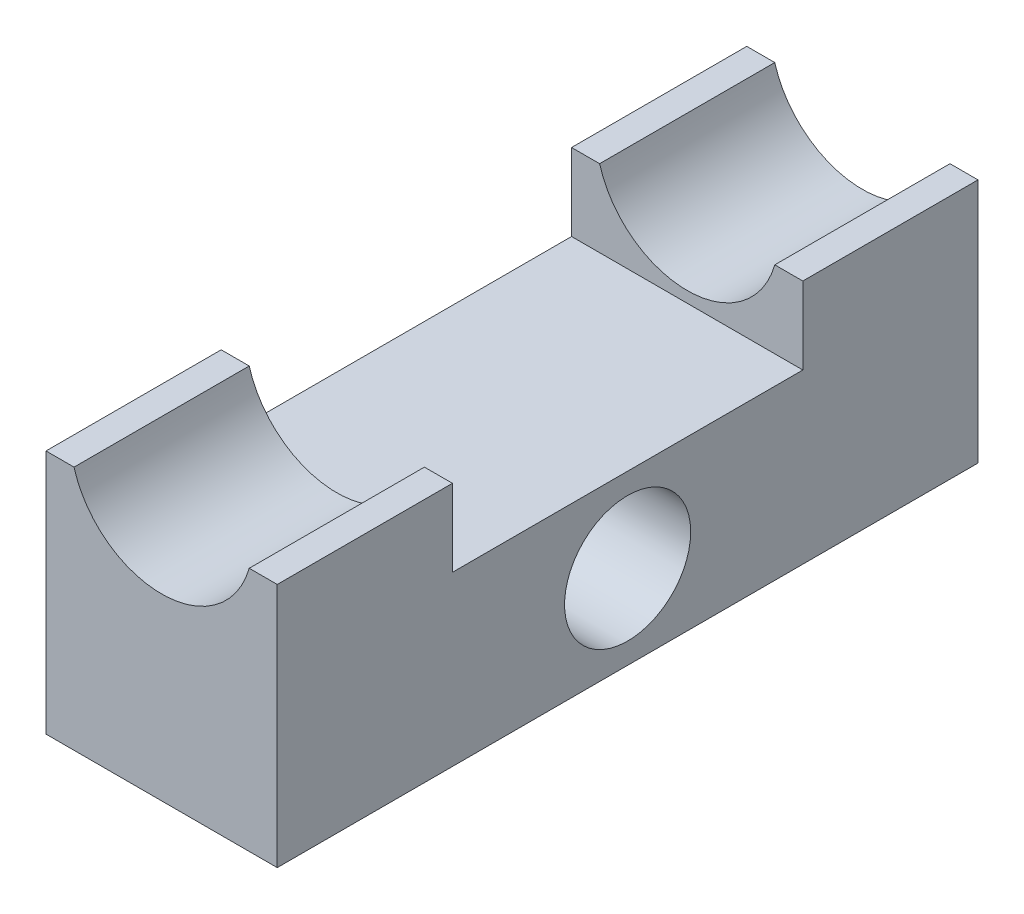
ISO-10303-21;
HEADER;
FILE_DESCRIPTION(('STEP AP214'),'2;1');
FILE_NAME('part.step','',(''),(''),'','','');
FILE_SCHEMA(('AUTOMOTIVE_DESIGN { 1 0 10303 214 1 1 1 1 }'));
ENDSEC;
DATA;
#1=APPLICATION_CONTEXT('core data for automotive mechanical design processes');
#2=APPLICATION_PROTOCOL_DEFINITION('international standard','automotive_design',2000,#1);
#3=PRODUCT_CONTEXT('',#1,'mechanical');
#4=PRODUCT('Part','Part','',(#3));
#5=PRODUCT_RELATED_PRODUCT_CATEGORY('part','',(#4));
#6=PRODUCT_DEFINITION_FORMATION('','',#4);
#7=PRODUCT_DEFINITION_CONTEXT('part definition',#1,'design');
#8=PRODUCT_DEFINITION('design','',#6,#7);
#9=PRODUCT_DEFINITION_SHAPE('','',#8);
#10=(LENGTH_UNIT() NAMED_UNIT(*) SI_UNIT(.MILLI.,.METRE.));
#11=(NAMED_UNIT(*) PLANE_ANGLE_UNIT() SI_UNIT($,.RADIAN.));
#12=(NAMED_UNIT(*) SI_UNIT($,.STERADIAN.) SOLID_ANGLE_UNIT());
#13=UNCERTAINTY_MEASURE_WITH_UNIT(LENGTH_MEASURE(1.E-05),#10,'distance_accuracy_value','');
#14=(GEOMETRIC_REPRESENTATION_CONTEXT(3) GLOBAL_UNCERTAINTY_ASSIGNED_CONTEXT((#13)) GLOBAL_UNIT_ASSIGNED_CONTEXT((#10,
#11,#12)) REPRESENTATION_CONTEXT('',''));
#15=CARTESIAN_POINT('',(0.,0.,0.));
#16=DIRECTION('',(0.,0.,1.));
#17=DIRECTION('',(1.,0.,0.));
#18=AXIS2_PLACEMENT_3D('',#15,#16,#17);
#19=CARTESIAN_POINT('',(1020.,392.299220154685,100.));
#20=DIRECTION('',(0.,0.,-1.));
#21=DIRECTION('',(-1.,0.,0.));
#22=AXIS2_PLACEMENT_3D('',#19,#20,#21);
#23=CYLINDRICAL_SURFACE('',#22,13.);
#24=DIRECTION('',(0.,0.,-1.));
#25=VECTOR('',#24,1.);
#26=CARTESIAN_POINT('',(1032.5,388.728505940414,100.));
#27=LINE('',#26,#25);
#28=CARTESIAN_POINT('',(1032.5,388.728505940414,100.));
#29=VERTEX_POINT('',#28);
#30=CARTESIAN_POINT('',(1032.5,388.728505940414,75.));
#31=VERTEX_POINT('',#30);
#32=EDGE_CURVE('E159',#29,#31,#27,.T.);
#33=ORIENTED_EDGE('',*,*,#32,.T.);
#34=CARTESIAN_POINT('',(1020.,392.299220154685,75.));
#35=DIRECTION('',(0.,0.,1.));
#36=DIRECTION('',(1.,0.,0.));
#37=AXIS2_PLACEMENT_3D('',#34,#35,#36);
#38=CIRCLE('',#37,13.);
#39=CARTESIAN_POINT('',(1007.5,388.728505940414,75.));
#40=VERTEX_POINT('',#39);
#41=EDGE_CURVE('E213',#31,#40,#38,.F.);
#42=ORIENTED_EDGE('',*,*,#41,.T.);
#43=DIRECTION('',(0.,0.,-1.));
#44=VECTOR('',#43,1.);
#45=CARTESIAN_POINT('',(1007.5,388.728505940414,100.));
#46=LINE('',#45,#44);
#47=CARTESIAN_POINT('',(1007.5,388.728505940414,100.));
#48=VERTEX_POINT('',#47);
#49=EDGE_CURVE('E170',#48,#40,#46,.T.);
#50=ORIENTED_EDGE('',*,*,#49,.F.);
#51=CARTESIAN_POINT('',(1020.,392.299220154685,100.));
#52=DIRECTION('',(0.,0.,-1.));
#53=DIRECTION('',(1.,0.,0.));
#54=AXIS2_PLACEMENT_3D('',#51,#52,#53);
#55=CIRCLE('',#54,13.);
#56=EDGE_CURVE('E158',#29,#48,#55,.T.);
#57=ORIENTED_EDGE('',*,*,#56,.F.);
#58=EDGE_LOOP('',(#33,#42,#50,#57));
#59=FACE_BOUND('',#58,.T.);
#60=ADVANCED_FACE('F44',(#59),#23,.F.);
#61=CARTESIAN_POINT('',(1007.5,388.728505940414,100.));
#62=DIRECTION('',(0.,-1.,0.));
#63=DIRECTION('',(0.,0.,-1.));
#64=AXIS2_PLACEMENT_3D('',#61,#62,#63);
#65=PLANE('',#64);
#66=ORIENTED_EDGE('',*,*,#49,.T.);
#67=DIRECTION('',(1.,0.,0.));
#68=VECTOR('',#67,1.);
#69=CARTESIAN_POINT('',(936.5,388.728505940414,75.));
#70=LINE('',#69,#68);
#71=CARTESIAN_POINT('',(1003.5,388.728505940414,75.));
#72=VERTEX_POINT('',#71);
#73=EDGE_CURVE('E196',#72,#40,#70,.T.);
#74=ORIENTED_EDGE('',*,*,#73,.F.);
#75=DIRECTION('',(0.,0.,-1.));
#76=VECTOR('',#75,1.);
#77=CARTESIAN_POINT('',(1003.5,388.728505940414,100.));
#78=LINE('',#77,#76);
#79=CARTESIAN_POINT('',(1003.5,388.728505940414,100.));
#80=VERTEX_POINT('',#79);
#81=EDGE_CURVE('E166',#80,#72,#78,.T.);
#82=ORIENTED_EDGE('',*,*,#81,.F.);
#83=DIRECTION('',(-1.,0.,0.));
#84=VECTOR('',#83,1.);
#85=CARTESIAN_POINT('',(1007.5,388.728505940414,100.));
#86=LINE('',#85,#84);
#87=EDGE_CURVE('E105',#48,#80,#86,.T.);
#88=ORIENTED_EDGE('',*,*,#87,.F.);
#89=EDGE_LOOP('',(#66,#74,#82,#88));
#90=FACE_BOUND('',#89,.T.);
#91=ADVANCED_FACE('F228',(#90),#65,.F.);
#92=CARTESIAN_POINT('',(1036.5,388.728505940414,100.));
#93=DIRECTION('',(0.,-1.,0.));
#94=DIRECTION('',(0.,0.,-1.));
#95=AXIS2_PLACEMENT_3D('',#92,#93,#94);
#96=PLANE('',#95);
#97=DIRECTION('',(0.,0.,-1.));
#98=VECTOR('',#97,1.);
#99=CARTESIAN_POINT('',(1036.5,388.728505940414,100.));
#100=LINE('',#99,#98);
#101=CARTESIAN_POINT('',(1036.5,388.728505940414,100.));
#102=VERTEX_POINT('',#101);
#103=CARTESIAN_POINT('',(1036.5,388.728505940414,75.));
#104=VERTEX_POINT('',#103);
#105=EDGE_CURVE('E135',#102,#104,#100,.T.);
#106=ORIENTED_EDGE('',*,*,#105,.T.);
#107=DIRECTION('',(-1.,0.,0.));
#108=VECTOR('',#107,1.);
#109=CARTESIAN_POINT('',(1036.5,388.728505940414,75.));
#110=LINE('',#109,#108);
#111=EDGE_CURVE('E13',#104,#31,#110,.T.);
#112=ORIENTED_EDGE('',*,*,#111,.T.);
#113=ORIENTED_EDGE('',*,*,#32,.F.);
#114=DIRECTION('',(-1.,0.,0.));
#115=VECTOR('',#114,1.);
#116=CARTESIAN_POINT('',(1036.5,388.728505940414,100.));
#117=LINE('',#116,#115);
#118=EDGE_CURVE('E68',#102,#29,#117,.T.);
#119=ORIENTED_EDGE('',*,*,#118,.F.);
#120=EDGE_LOOP('',(#106,#112,#113,#119));
#121=FACE_BOUND('',#120,.T.);
#122=ADVANCED_FACE('F259',(#121),#96,.F.);
#123=CARTESIAN_POINT('',(1007.5,388.728505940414,25.));
#124=VERTEX_POINT('',#123);
#125=CARTESIAN_POINT('',(1007.5,388.728505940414,0.));
#126=VERTEX_POINT('',#125);
#127=EDGE_CURVE('E169',#124,#126,#46,.T.);
#128=ORIENTED_EDGE('',*,*,#127,.F.);
#129=CARTESIAN_POINT('',(1020.,392.299220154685,25.));
#130=DIRECTION('',(0.,0.,-1.));
#131=DIRECTION('',(0.,1.,0.));
#132=AXIS2_PLACEMENT_3D('',#129,#130,#131);
#133=CIRCLE('',#132,13.);
#134=CARTESIAN_POINT('',(1032.5,388.728505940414,25.));
#135=VERTEX_POINT('',#134);
#136=EDGE_CURVE('E185',#124,#135,#133,.F.);
#137=ORIENTED_EDGE('',*,*,#136,.T.);
#138=CARTESIAN_POINT('',(1032.5,388.728505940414,0.));
#139=VERTEX_POINT('',#138);
#140=EDGE_CURVE('E96',#135,#139,#27,.T.);
#141=ORIENTED_EDGE('',*,*,#140,.T.);
#142=CARTESIAN_POINT('',(1020.,392.299220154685,0.));
#143=DIRECTION('',(0.,0.,-1.));
#144=DIRECTION('',(1.,0.,0.));
#145=AXIS2_PLACEMENT_3D('',#142,#143,#144);
#146=CIRCLE('',#145,13.);
#147=EDGE_CURVE('E145',#139,#126,#146,.T.);
#148=ORIENTED_EDGE('',*,*,#147,.T.);
#149=EDGE_LOOP('',(#128,#137,#141,#148));
#150=FACE_BOUND('',#149,.T.);
#151=ADVANCED_FACE('F46',(#150),#23,.F.);
#152=CARTESIAN_POINT('',(1003.5,388.728505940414,25.));
#153=VERTEX_POINT('',#152);
#154=CARTESIAN_POINT('',(1003.5,388.728505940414,0.));
#155=VERTEX_POINT('',#154);
#156=EDGE_CURVE('E165',#153,#155,#78,.T.);
#157=ORIENTED_EDGE('',*,*,#156,.F.);
#158=DIRECTION('',(1.,0.,0.));
#159=VECTOR('',#158,1.);
#160=CARTESIAN_POINT('',(936.5,388.728505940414,25.));
#161=LINE('',#160,#159);
#162=EDGE_CURVE('E193',#153,#124,#161,.T.);
#163=ORIENTED_EDGE('',*,*,#162,.T.);
#164=ORIENTED_EDGE('',*,*,#127,.T.);
#165=DIRECTION('',(-1.,0.,0.));
#166=VECTOR('',#165,1.);
#167=CARTESIAN_POINT('',(1007.5,388.728505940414,0.));
#168=LINE('',#167,#166);
#169=EDGE_CURVE('E147',#126,#155,#168,.T.);
#170=ORIENTED_EDGE('',*,*,#169,.T.);
#171=EDGE_LOOP('',(#157,#163,#164,#170));
#172=FACE_BOUND('',#171,.T.);
#173=ADVANCED_FACE('F191',(#172),#65,.F.);
#174=CARTESIAN_POINT('',(1003.5,388.728505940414,100.));
#175=DIRECTION('',(1.,0.,0.));
#176=DIRECTION('',(0.,0.,-1.));
#177=AXIS2_PLACEMENT_3D('',#174,#175,#176);
#178=PLANE('',#177);
#179=ORIENTED_EDGE('',*,*,#81,.T.);
#180=DIRECTION('',(0.,-1.,0.));
#181=VECTOR('',#180,1.);
#182=CARTESIAN_POINT('',(1003.5,388.728505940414,75.));
#183=LINE('',#182,#181);
#184=CARTESIAN_POINT('',(1003.5,377.728505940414,75.));
#185=VERTEX_POINT('',#184);
#186=EDGE_CURVE('E210',#72,#185,#183,.T.);
#187=ORIENTED_EDGE('',*,*,#186,.T.);
#188=DIRECTION('',(0.,0.,-1.));
#189=VECTOR('',#188,1.);
#190=CARTESIAN_POINT('',(1003.5,377.728505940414,100.));
#191=LINE('',#190,#189);
#192=CARTESIAN_POINT('',(1003.5,377.728505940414,25.));
#193=VERTEX_POINT('',#192);
#194=EDGE_CURVE('E216',#185,#193,#191,.T.);
#195=ORIENTED_EDGE('',*,*,#194,.T.);
#196=DIRECTION('',(0.,1.,0.));
#197=VECTOR('',#196,1.);
#198=CARTESIAN_POINT('',(1003.5,388.728505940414,25.));
#199=LINE('',#198,#197);
#200=EDGE_CURVE('E200',#193,#153,#199,.T.);
#201=ORIENTED_EDGE('',*,*,#200,.T.);
#202=ORIENTED_EDGE('',*,*,#156,.T.);
#203=DIRECTION('',(0.,-1.,0.));
#204=VECTOR('',#203,1.);
#205=CARTESIAN_POINT('',(1003.5,388.728505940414,0.));
#206=LINE('',#205,#204);
#207=CARTESIAN_POINT('',(1003.5,353.728505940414,0.));
#208=VERTEX_POINT('',#207);
#209=EDGE_CURVE('E151',#155,#208,#206,.T.);
#210=ORIENTED_EDGE('',*,*,#209,.T.);
#211=DIRECTION('',(0.,0.,-1.));
#212=VECTOR('',#211,1.);
#213=CARTESIAN_POINT('',(1003.5,353.728505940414,100.));
#214=LINE('',#213,#212);
#215=CARTESIAN_POINT('',(1003.5,353.728505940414,100.));
#216=VERTEX_POINT('',#215);
#217=EDGE_CURVE('E134',#216,#208,#214,.T.);
#218=ORIENTED_EDGE('',*,*,#217,.F.);
#219=DIRECTION('',(0.,-1.,0.));
#220=VECTOR('',#219,1.);
#221=CARTESIAN_POINT('',(1003.5,388.728505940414,100.));
#222=LINE('',#221,#220);
#223=EDGE_CURVE('E121',#80,#216,#222,.T.);
#224=ORIENTED_EDGE('',*,*,#223,.F.);
#225=EDGE_LOOP('',(#179,#187,#195,#201,#202,#210,#218,#224));
#226=FACE_BOUND('',#225,.T.);
#227=CARTESIAN_POINT('',(1003.5,365.728505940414,50.));
#228=DIRECTION('',(1.,0.,0.));
#229=DIRECTION('',(0.,0.,-1.));
#230=AXIS2_PLACEMENT_3D('',#227,#228,#229);
#231=CIRCLE('',#230,9.00000000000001);
#232=CARTESIAN_POINT('',(1003.5,365.728505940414,41.));
#233=VERTEX_POINT('',#232);
#234=EDGE_CURVE('E148',#233,#233,#231,.T.);
#235=ORIENTED_EDGE('',*,*,#234,.T.);
#236=EDGE_LOOP('',(#235));
#237=FACE_BOUND('',#236,.T.);
#238=ADVANCED_FACE('F231',(#226,#237),#178,.F.);
#239=CARTESIAN_POINT('',(1003.5,353.728505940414,100.));
#240=DIRECTION('',(0.,1.,0.));
#241=DIRECTION('',(0.,0.,1.));
#242=AXIS2_PLACEMENT_3D('',#239,#240,#241);
#243=PLANE('',#242);
#244=DIRECTION('',(1.,0.,0.));
#245=VECTOR('',#244,1.);
#246=CARTESIAN_POINT('',(1003.5,353.728505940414,0.));
#247=LINE('',#246,#245);
#248=CARTESIAN_POINT('',(1036.5,353.728505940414,0.));
#249=VERTEX_POINT('',#248);
#250=EDGE_CURVE('E130',#208,#249,#247,.T.);
#251=ORIENTED_EDGE('',*,*,#250,.T.);
#252=DIRECTION('',(0.,0.,-1.));
#253=VECTOR('',#252,1.);
#254=CARTESIAN_POINT('',(1036.5,353.728505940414,100.));
#255=LINE('',#254,#253);
#256=CARTESIAN_POINT('',(1036.5,353.728505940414,100.));
#257=VERTEX_POINT('',#256);
#258=EDGE_CURVE('E127',#257,#249,#255,.T.);
#259=ORIENTED_EDGE('',*,*,#258,.F.);
#260=DIRECTION('',(1.,0.,0.));
#261=VECTOR('',#260,1.);
#262=CARTESIAN_POINT('',(1003.5,353.728505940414,100.));
#263=LINE('',#262,#261);
#264=EDGE_CURVE('E114',#216,#257,#263,.T.);
#265=ORIENTED_EDGE('',*,*,#264,.F.);
#266=ORIENTED_EDGE('',*,*,#217,.T.);
#267=EDGE_LOOP('',(#251,#259,#265,#266));
#268=FACE_BOUND('',#267,.T.);
#269=ADVANCED_FACE('F128',(#268),#243,.F.);
#270=CARTESIAN_POINT('',(1036.5,353.728505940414,100.));
#271=DIRECTION('',(-1.,0.,0.));
#272=DIRECTION('',(0.,0.,1.));
#273=AXIS2_PLACEMENT_3D('',#270,#271,#272);
#274=PLANE('',#273);
#275=CARTESIAN_POINT('',(1036.5,365.728505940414,50.));
#276=DIRECTION('',(1.,0.,0.));
#277=DIRECTION('',(0.,0.,-1.));
#278=AXIS2_PLACEMENT_3D('',#275,#276,#277);
#279=CIRCLE('',#278,9.00000000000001);
#280=CARTESIAN_POINT('',(1036.5,365.728505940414,41.));
#281=VERTEX_POINT('',#280);
#282=EDGE_CURVE('E219',#281,#281,#279,.T.);
#283=ORIENTED_EDGE('',*,*,#282,.F.);
#284=EDGE_LOOP('',(#283));
#285=FACE_BOUND('',#284,.T.);
#286=DIRECTION('',(0.,0.,-1.));
#287=VECTOR('',#286,1.);
#288=CARTESIAN_POINT('',(1036.5,377.728505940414,75.));
#289=LINE('',#288,#287);
#290=CARTESIAN_POINT('',(1036.5,377.728505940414,75.));
#291=VERTEX_POINT('',#290);
#292=CARTESIAN_POINT('',(1036.5,377.728505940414,25.));
#293=VERTEX_POINT('',#292);
#294=EDGE_CURVE('E244',#291,#293,#289,.T.);
#295=ORIENTED_EDGE('',*,*,#294,.F.);
#296=DIRECTION('',(0.,-1.,0.));
#297=VECTOR('',#296,1.);
#298=CARTESIAN_POINT('',(1036.5,388.728505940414,75.));
#299=LINE('',#298,#297);
#300=EDGE_CURVE('E248',#104,#291,#299,.T.);
#301=ORIENTED_EDGE('',*,*,#300,.F.);
#302=ORIENTED_EDGE('',*,*,#105,.F.);
#303=DIRECTION('',(0.,1.,0.));
#304=VECTOR('',#303,1.);
#305=CARTESIAN_POINT('',(1036.5,353.728505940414,100.));
#306=LINE('',#305,#304);
#307=EDGE_CURVE('E118',#257,#102,#306,.T.);
#308=ORIENTED_EDGE('',*,*,#307,.F.);
#309=ORIENTED_EDGE('',*,*,#258,.T.);
#310=DIRECTION('',(0.,1.,0.));
#311=VECTOR('',#310,1.);
#312=CARTESIAN_POINT('',(1036.5,353.728505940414,0.));
#313=LINE('',#312,#311);
#314=CARTESIAN_POINT('',(1036.5,388.728505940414,0.));
#315=VERTEX_POINT('',#314);
#316=EDGE_CURVE('E154',#249,#315,#313,.T.);
#317=ORIENTED_EDGE('',*,*,#316,.T.);
#318=CARTESIAN_POINT('',(1036.5,388.728505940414,25.));
#319=VERTEX_POINT('',#318);
#320=EDGE_CURVE('E162',#319,#315,#100,.T.);
#321=ORIENTED_EDGE('',*,*,#320,.F.);
#322=DIRECTION('',(0.,1.,0.));
#323=VECTOR('',#322,1.);
#324=CARTESIAN_POINT('',(1036.5,388.728505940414,25.));
#325=LINE('',#324,#323);
#326=EDGE_CURVE('E59',#293,#319,#325,.T.);
#327=ORIENTED_EDGE('',*,*,#326,.F.);
#328=EDGE_LOOP('',(#295,#301,#302,#308,#309,#317,#321,#327));
#329=FACE_BOUND('',#328,.T.);
#330=ADVANCED_FACE('F138',(#285,#329),#274,.F.);
#331=ORIENTED_EDGE('',*,*,#140,.F.);
#332=DIRECTION('',(1.,0.,0.));
#333=VECTOR('',#332,1.);
#334=CARTESIAN_POINT('',(1036.5,388.728505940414,25.));
#335=LINE('',#334,#333);
#336=EDGE_CURVE('E52',#135,#319,#335,.T.);
#337=ORIENTED_EDGE('',*,*,#336,.T.);
#338=ORIENTED_EDGE('',*,*,#320,.T.);
#339=DIRECTION('',(-1.,0.,0.));
#340=VECTOR('',#339,1.);
#341=CARTESIAN_POINT('',(1036.5,388.728505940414,0.));
#342=LINE('',#341,#340);
#343=EDGE_CURVE('E156',#315,#139,#342,.T.);
#344=ORIENTED_EDGE('',*,*,#343,.T.);
#345=EDGE_LOOP('',(#331,#337,#338,#344));
#346=FACE_BOUND('',#345,.T.);
#347=ADVANCED_FACE('F173',(#346),#96,.F.);
#348=CARTESIAN_POINT('',(1020.,392.299220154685,100.));
#349=DIRECTION('',(0.,0.,1.));
#350=DIRECTION('',(1.,0.,0.));
#351=AXIS2_PLACEMENT_3D('',#348,#349,#350);
#352=PLANE('',#351);
#353=ORIENTED_EDGE('',*,*,#56,.T.);
#354=ORIENTED_EDGE('',*,*,#87,.T.);
#355=ORIENTED_EDGE('',*,*,#223,.T.);
#356=ORIENTED_EDGE('',*,*,#264,.T.);
#357=ORIENTED_EDGE('',*,*,#307,.T.);
#358=ORIENTED_EDGE('',*,*,#118,.T.);
#359=EDGE_LOOP('',(#353,#354,#355,#356,#357,#358));
#360=FACE_BOUND('',#359,.T.);
#361=ADVANCED_FACE('F116',(#360),#352,.T.);
#362=CARTESIAN_POINT('',(1020.,392.299220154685,0.));
#363=DIRECTION('',(0.,0.,1.));
#364=DIRECTION('',(1.,0.,0.));
#365=AXIS2_PLACEMENT_3D('',#362,#363,#364);
#366=PLANE('',#365);
#367=ORIENTED_EDGE('',*,*,#147,.F.);
#368=ORIENTED_EDGE('',*,*,#343,.F.);
#369=ORIENTED_EDGE('',*,*,#316,.F.);
#370=ORIENTED_EDGE('',*,*,#250,.F.);
#371=ORIENTED_EDGE('',*,*,#209,.F.);
#372=ORIENTED_EDGE('',*,*,#169,.F.);
#373=EDGE_LOOP('',(#367,#368,#369,#370,#371,#372));
#374=FACE_BOUND('',#373,.T.);
#375=ADVANCED_FACE('F180',(#374),#366,.F.);
#376=CARTESIAN_POINT('',(936.5,365.728505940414,50.));
#377=DIRECTION('',(1.,0.,0.));
#378=DIRECTION('',(0.,0.,-1.));
#379=AXIS2_PLACEMENT_3D('',#376,#377,#378);
#380=CYLINDRICAL_SURFACE('',#379,9.00000000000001);
#381=ORIENTED_EDGE('',*,*,#282,.T.);
#382=EDGE_LOOP('',(#381));
#383=FACE_BOUND('',#382,.T.);
#384=ORIENTED_EDGE('',*,*,#234,.F.);
#385=EDGE_LOOP('',(#384));
#386=FACE_BOUND('',#385,.T.);
#387=ADVANCED_FACE('F318',(#383,#386),#380,.F.);
#388=CARTESIAN_POINT('',(936.5,377.728505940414,75.));
#389=DIRECTION('',(0.,-1.,0.));
#390=DIRECTION('',(0.,0.,-1.));
#391=AXIS2_PLACEMENT_3D('',#388,#389,#390);
#392=PLANE('',#391);
#393=DIRECTION('',(1.,0.,0.));
#394=VECTOR('',#393,1.);
#395=CARTESIAN_POINT('',(936.5,377.728505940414,75.));
#396=LINE('',#395,#394);
#397=EDGE_CURVE('E202',#185,#291,#396,.T.);
#398=ORIENTED_EDGE('',*,*,#397,.T.);
#399=ORIENTED_EDGE('',*,*,#294,.T.);
#400=DIRECTION('',(1.,0.,0.));
#401=VECTOR('',#400,1.);
#402=CARTESIAN_POINT('',(936.5,377.728505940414,25.));
#403=LINE('',#402,#401);
#404=EDGE_CURVE('E197',#193,#293,#403,.T.);
#405=ORIENTED_EDGE('',*,*,#404,.F.);
#406=ORIENTED_EDGE('',*,*,#194,.F.);
#407=EDGE_LOOP('',(#398,#399,#405,#406));
#408=FACE_BOUND('',#407,.T.);
#409=ADVANCED_FACE('F242',(#408),#392,.F.);
#410=CARTESIAN_POINT('',(936.5,388.728505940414,75.));
#411=DIRECTION('',(0.,0.,1.));
#412=DIRECTION('',(1.,0.,0.));
#413=AXIS2_PLACEMENT_3D('',#410,#411,#412);
#414=PLANE('',#413);
#415=ORIENTED_EDGE('',*,*,#111,.F.);
#416=ORIENTED_EDGE('',*,*,#300,.T.);
#417=ORIENTED_EDGE('',*,*,#397,.F.);
#418=ORIENTED_EDGE('',*,*,#186,.F.);
#419=ORIENTED_EDGE('',*,*,#73,.T.);
#420=ORIENTED_EDGE('',*,*,#41,.F.);
#421=EDGE_LOOP('',(#415,#416,#417,#418,#419,#420));
#422=FACE_BOUND('',#421,.T.);
#423=ADVANCED_FACE('F253',(#422),#414,.F.);
#424=CARTESIAN_POINT('',(936.5,388.728505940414,25.));
#425=DIRECTION('',(0.,0.,-1.));
#426=DIRECTION('',(0.,1.,0.));
#427=AXIS2_PLACEMENT_3D('',#424,#425,#426);
#428=PLANE('',#427);
#429=ORIENTED_EDGE('',*,*,#162,.F.);
#430=ORIENTED_EDGE('',*,*,#200,.F.);
#431=ORIENTED_EDGE('',*,*,#404,.T.);
#432=ORIENTED_EDGE('',*,*,#326,.T.);
#433=ORIENTED_EDGE('',*,*,#336,.F.);
#434=ORIENTED_EDGE('',*,*,#136,.F.);
#435=EDGE_LOOP('',(#429,#430,#431,#432,#433,#434));
#436=FACE_BOUND('',#435,.T.);
#437=ADVANCED_FACE('F237',(#436),#428,.F.);
#438=CLOSED_SHELL('',(#60,#91,#122,#151,#173,#238,#269,#330,#347,#361,#375,#387,#409,#423,#437));
#439=MANIFOLD_SOLID_BREP('B2',#438);
#440=ADVANCED_BREP_SHAPE_REPRESENTATION('',(#18,#439),#14);
#441=SHAPE_DEFINITION_REPRESENTATION(#9,#440);
ENDSEC;
END-ISO-10303-21;
